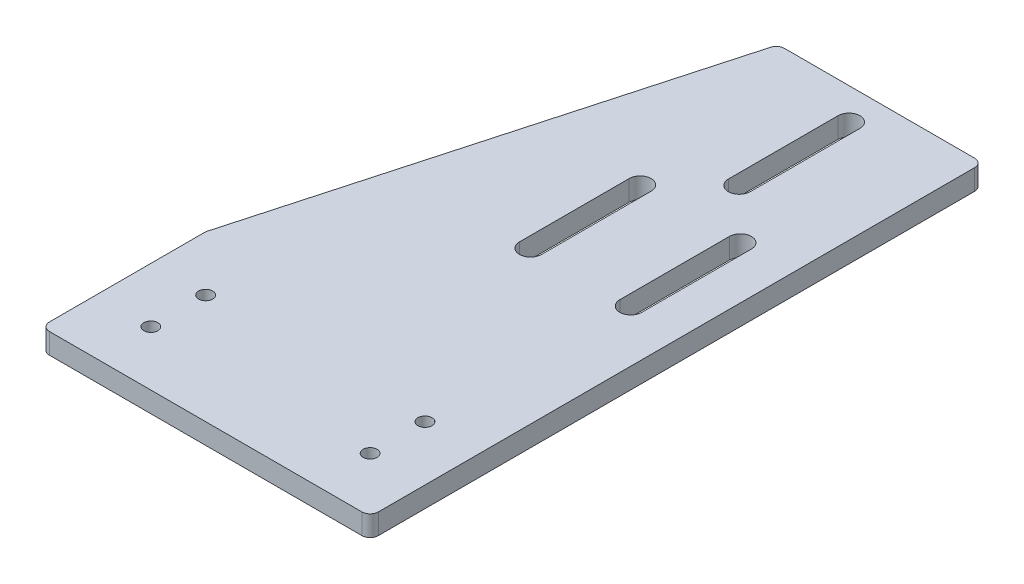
ISO-10303-21;
HEADER;
FILE_DESCRIPTION(('STEP AP214'),'2;1');
FILE_NAME('part.step','',(''),(''),'','','');
FILE_SCHEMA(('AUTOMOTIVE_DESIGN { 1 0 10303 214 1 1 1 1 }'));
ENDSEC;
DATA;
#1=APPLICATION_CONTEXT('core data for automotive mechanical design processes');
#2=APPLICATION_PROTOCOL_DEFINITION('international standard','automotive_design',2000,#1);
#3=PRODUCT_CONTEXT('',#1,'mechanical');
#4=PRODUCT('Part','Part','',(#3));
#5=PRODUCT_RELATED_PRODUCT_CATEGORY('part','',(#4));
#6=PRODUCT_DEFINITION_FORMATION('','',#4);
#7=PRODUCT_DEFINITION_CONTEXT('part definition',#1,'design');
#8=PRODUCT_DEFINITION('design','',#6,#7);
#9=PRODUCT_DEFINITION_SHAPE('','',#8);
#10=(LENGTH_UNIT() NAMED_UNIT(*) SI_UNIT(.MILLI.,.METRE.));
#11=(NAMED_UNIT(*) PLANE_ANGLE_UNIT() SI_UNIT($,.RADIAN.));
#12=(NAMED_UNIT(*) SI_UNIT($,.STERADIAN.) SOLID_ANGLE_UNIT());
#13=UNCERTAINTY_MEASURE_WITH_UNIT(LENGTH_MEASURE(1.E-05),#10,'distance_accuracy_value','');
#14=(GEOMETRIC_REPRESENTATION_CONTEXT(3) GLOBAL_UNCERTAINTY_ASSIGNED_CONTEXT((#13)) GLOBAL_UNIT_ASSIGNED_CONTEXT((#10,
#11,#12)) REPRESENTATION_CONTEXT('',''));
#15=CARTESIAN_POINT('',(0.,0.,0.));
#16=DIRECTION('',(0.,0.,1.));
#17=DIRECTION('',(1.,0.,0.));
#18=AXIS2_PLACEMENT_3D('',#15,#16,#17);
#19=CARTESIAN_POINT('',(43.583703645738,9.525,224.79));
#20=DIRECTION('',(0.,1.,0.));
#21=DIRECTION('',(0.,0.,1.));
#22=AXIS2_PLACEMENT_3D('',#19,#20,#21);
#23=PLANE('',#22);
#24=CARTESIAN_POINT('',(-79.606296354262,9.525,203.2));
#25=DIRECTION('',(0.,1.,0.));
#26=DIRECTION('',(0.,0.,1.));
#27=AXIS2_PLACEMENT_3D('',#24,#25,#26);
#28=CIRCLE('',#27,3.25119999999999);
#29=CARTESIAN_POINT('',(-79.606296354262,9.525,199.9488));
#30=VERTEX_POINT('',#29);
#31=EDGE_CURVE('E267',#30,#30,#28,.T.);
#32=ORIENTED_EDGE('',*,*,#31,.F.);
#33=EDGE_LOOP('',(#32));
#34=FACE_BOUND('',#33,.T.);
#35=CARTESIAN_POINT('',(21.993703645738,9.525,203.2));
#36=DIRECTION('',(0.,1.,0.));
#37=DIRECTION('',(0.,0.,1.));
#38=AXIS2_PLACEMENT_3D('',#35,#36,#37);
#39=CIRCLE('',#38,3.2512);
#40=CARTESIAN_POINT('',(21.993703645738,9.525,199.9488));
#41=VERTEX_POINT('',#40);
#42=EDGE_CURVE('E279',#41,#41,#39,.T.);
#43=ORIENTED_EDGE('',*,*,#42,.F.);
#44=EDGE_LOOP('',(#43));
#45=FACE_BOUND('',#44,.T.);
#46=CARTESIAN_POINT('',(43.583703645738,9.525,224.79));
#47=DIRECTION('',(0.,1.,0.));
#48=DIRECTION('',(0.,0.,1.));
#49=AXIS2_PLACEMENT_3D('',#46,#47,#48);
#50=CIRCLE('',#49,3.81);
#51=CARTESIAN_POINT('',(43.583703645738,9.525,228.6));
#52=VERTEX_POINT('',#51);
#53=CARTESIAN_POINT('',(47.393703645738,9.525,224.79));
#54=VERTEX_POINT('',#53);
#55=EDGE_CURVE('E316',#52,#54,#50,.T.);
#56=ORIENTED_EDGE('',*,*,#55,.T.);
#57=DIRECTION('',(0.,0.,-1.));
#58=VECTOR('',#57,1.);
#59=CARTESIAN_POINT('',(47.393703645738,9.525,-51.435));
#60=LINE('',#59,#58);
#61=CARTESIAN_POINT('',(47.393703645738,9.525,-51.435));
#62=VERTEX_POINT('',#61);
#63=EDGE_CURVE('E319',#54,#62,#60,.T.);
#64=ORIENTED_EDGE('',*,*,#63,.T.);
#65=CARTESIAN_POINT('',(43.583703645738,9.525,-51.435));
#66=DIRECTION('',(0.,1.,0.));
#67=DIRECTION('',(0.,0.,1.));
#68=AXIS2_PLACEMENT_3D('',#65,#66,#67);
#69=CIRCLE('',#68,3.81);
#70=CARTESIAN_POINT('',(43.583703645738,9.525,-55.245));
#71=VERTEX_POINT('',#70);
#72=EDGE_CURVE('E322',#62,#71,#69,.T.);
#73=ORIENTED_EDGE('',*,*,#72,.T.);
#74=DIRECTION('',(-1.,0.,0.));
#75=VECTOR('',#74,1.);
#76=CARTESIAN_POINT('',(-44.4968825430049,9.525,-55.245));
#77=LINE('',#76,#75);
#78=CARTESIAN_POINT('',(-44.4968825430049,9.525,-55.245));
#79=VERTEX_POINT('',#78);
#80=EDGE_CURVE('E324',#71,#79,#77,.T.);
#81=ORIENTED_EDGE('',*,*,#80,.T.);
#82=CARTESIAN_POINT('',(-44.4968825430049,9.525,-51.435));
#83=DIRECTION('',(0.,1.,0.));
#84=DIRECTION('',(0.,0.,-1.));
#85=AXIS2_PLACEMENT_3D('',#82,#83,#84);
#86=CIRCLE('',#85,3.81);
#87=CARTESIAN_POINT('',(-48.1681891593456,9.525,-52.4536303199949));
#88=VERTEX_POINT('',#87);
#89=EDGE_CURVE('E326',#79,#88,#86,.T.);
#90=ORIENTED_EDGE('',*,*,#89,.T.);
#91=DIRECTION('',(-0.267357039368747,0.,0.963597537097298));
#92=VECTOR('',#91,1.);
#93=CARTESIAN_POINT('',(-48.1681891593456,9.525,-52.4536303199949));
#94=LINE('',#93,#92);
#95=CARTESIAN_POINT('',(-104.867602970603,9.525,151.900126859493));
#96=VERTEX_POINT('',#95);
#97=EDGE_CURVE('E328',#88,#96,#94,.T.);
#98=ORIENTED_EDGE('',*,*,#97,.T.);
#99=CARTESIAN_POINT('',(-101.196296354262,9.525,152.918757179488));
#100=DIRECTION('',(0.,1.,0.));
#101=DIRECTION('',(0.,0.,1.));
#102=AXIS2_PLACEMENT_3D('',#99,#100,#101);
#103=CIRCLE('',#102,3.81);
#104=CARTESIAN_POINT('',(-105.006296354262,9.525,152.918757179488));
#105=VERTEX_POINT('',#104);
#106=EDGE_CURVE('E330',#96,#105,#103,.T.);
#107=ORIENTED_EDGE('',*,*,#106,.T.);
#108=DIRECTION('',(0.,0.,1.));
#109=VECTOR('',#108,1.);
#110=CARTESIAN_POINT('',(-105.006296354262,9.525,152.918757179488));
#111=LINE('',#110,#109);
#112=CARTESIAN_POINT('',(-105.006296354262,9.525,224.79));
#113=VERTEX_POINT('',#112);
#114=EDGE_CURVE('E332',#105,#113,#111,.T.);
#115=ORIENTED_EDGE('',*,*,#114,.T.);
#116=CARTESIAN_POINT('',(-101.196296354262,9.525,224.79));
#117=DIRECTION('',(0.,1.,0.));
#118=DIRECTION('',(0.,0.,1.));
#119=AXIS2_PLACEMENT_3D('',#116,#117,#118);
#120=CIRCLE('',#119,3.81);
#121=CARTESIAN_POINT('',(-101.196296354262,9.525,228.6));
#122=VERTEX_POINT('',#121);
#123=EDGE_CURVE('E334',#113,#122,#120,.T.);
#124=ORIENTED_EDGE('',*,*,#123,.T.);
#125=DIRECTION('',(1.,0.,0.));
#126=VECTOR('',#125,1.);
#127=CARTESIAN_POINT('',(-101.196296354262,9.525,228.6));
#128=LINE('',#127,#126);
#129=EDGE_CURVE('E336',#122,#52,#128,.T.);
#130=ORIENTED_EDGE('',*,*,#129,.T.);
#131=EDGE_LOOP('',(#56,#64,#73,#81,#90,#98,#107,#115,#124,#130));
#132=FACE_BOUND('',#131,.T.);
#133=DIRECTION('',(0.,0.,-1.));
#134=VECTOR('',#133,1.);
#135=CARTESIAN_POINT('',(28.343703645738,9.525,83.7428659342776));
#136=LINE('',#135,#134);
#137=CARTESIAN_POINT('',(28.343703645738,9.525,83.7428659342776));
#138=VERTEX_POINT('',#137);
#139=CARTESIAN_POINT('',(28.343703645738,9.525,32.9428659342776));
#140=VERTEX_POINT('',#139);
#141=EDGE_CURVE('E287',#138,#140,#136,.T.);
#142=ORIENTED_EDGE('',*,*,#141,.F.);
#143=CARTESIAN_POINT('',(23.263703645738,9.525,83.7428659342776));
#144=DIRECTION('',(0.,1.,0.));
#145=DIRECTION('',(0.,0.,1.));
#146=AXIS2_PLACEMENT_3D('',#143,#144,#145);
#147=CIRCLE('',#146,5.08);
#148=CARTESIAN_POINT('',(18.183703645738,9.525,83.7428659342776));
#149=VERTEX_POINT('',#148);
#150=EDGE_CURVE('E285',#149,#138,#147,.T.);
#151=ORIENTED_EDGE('',*,*,#150,.F.);
#152=DIRECTION('',(0.,0.,1.));
#153=VECTOR('',#152,1.);
#154=CARTESIAN_POINT('',(18.183703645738,9.525,83.7428659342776));
#155=LINE('',#154,#153);
#156=CARTESIAN_POINT('',(18.183703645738,9.525,32.9428659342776));
#157=VERTEX_POINT('',#156);
#158=EDGE_CURVE('E293',#157,#149,#155,.T.);
#159=ORIENTED_EDGE('',*,*,#158,.F.);
#160=CARTESIAN_POINT('',(23.263703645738,9.525,32.9428659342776));
#161=DIRECTION('',(0.,1.,0.));
#162=DIRECTION('',(0.,0.,1.));
#163=AXIS2_PLACEMENT_3D('',#160,#161,#162);
#164=CIRCLE('',#163,5.08);
#165=EDGE_CURVE('E290',#140,#157,#164,.T.);
#166=ORIENTED_EDGE('',*,*,#165,.F.);
#167=EDGE_LOOP('',(#142,#151,#159,#166));
#168=FACE_BOUND('',#167,.T.);
#169=CARTESIAN_POINT('',(21.993703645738,9.525,177.8));
#170=DIRECTION('',(0.,1.,0.));
#171=DIRECTION('',(0.,0.,1.));
#172=AXIS2_PLACEMENT_3D('',#169,#170,#171);
#173=CIRCLE('',#172,3.2512);
#174=CARTESIAN_POINT('',(21.993703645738,9.525,174.5488));
#175=VERTEX_POINT('',#174);
#176=EDGE_CURVE('E273',#175,#175,#173,.T.);
#177=ORIENTED_EDGE('',*,*,#176,.F.);
#178=EDGE_LOOP('',(#177));
#179=FACE_BOUND('',#178,.T.);
#180=CARTESIAN_POINT('',(-79.606296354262,9.525,177.8));
#181=DIRECTION('',(0.,1.,0.));
#182=DIRECTION('',(0.,0.,1.));
#183=AXIS2_PLACEMENT_3D('',#180,#181,#182);
#184=CIRCLE('',#183,3.25119999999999);
#185=CARTESIAN_POINT('',(-79.606296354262,9.525,174.5488));
#186=VERTEX_POINT('',#185);
#187=EDGE_CURVE('E261',#186,#186,#184,.T.);
#188=ORIENTED_EDGE('',*,*,#187,.F.);
#189=EDGE_LOOP('',(#188));
#190=FACE_BOUND('',#189,.T.);
#191=DIRECTION('',(0.,0.,-1.));
#192=VECTOR('',#191,1.);
#193=CARTESIAN_POINT('',(5.08,9.525,10.16));
#194=LINE('',#193,#192);
#195=CARTESIAN_POINT('',(5.08,9.525,10.16));
#196=VERTEX_POINT('',#195);
#197=CARTESIAN_POINT('',(5.08,9.525,-40.64));
#198=VERTEX_POINT('',#197);
#199=EDGE_CURVE('E232',#196,#198,#194,.T.);
#200=ORIENTED_EDGE('',*,*,#199,.F.);
#201=CARTESIAN_POINT('',(0.,9.525,10.16));
#202=DIRECTION('',(0.,1.,0.));
#203=DIRECTION('',(0.,0.,1.));
#204=AXIS2_PLACEMENT_3D('',#201,#202,#203);
#205=CIRCLE('',#204,5.08);
#206=CARTESIAN_POINT('',(-5.08,9.525,10.16));
#207=VERTEX_POINT('',#206);
#208=EDGE_CURVE('E230',#207,#196,#205,.T.);
#209=ORIENTED_EDGE('',*,*,#208,.F.);
#210=DIRECTION('',(0.,0.,1.));
#211=VECTOR('',#210,1.);
#212=CARTESIAN_POINT('',(-5.08,9.525,10.16));
#213=LINE('',#212,#211);
#214=CARTESIAN_POINT('',(-5.08,9.525,-40.64));
#215=VERTEX_POINT('',#214);
#216=EDGE_CURVE('E238',#215,#207,#213,.T.);
#217=ORIENTED_EDGE('',*,*,#216,.F.);
#218=CARTESIAN_POINT('',(0.,9.525,-40.64));
#219=DIRECTION('',(0.,1.,0.));
#220=DIRECTION('',(0.,0.,1.));
#221=AXIS2_PLACEMENT_3D('',#218,#219,#220);
#222=CIRCLE('',#221,5.08);
#223=EDGE_CURVE('E235',#198,#215,#222,.T.);
#224=ORIENTED_EDGE('',*,*,#223,.F.);
#225=EDGE_LOOP('',(#200,#209,#217,#224));
#226=FACE_BOUND('',#225,.T.);
#227=DIRECTION('',(0.,0.,-1.));
#228=VECTOR('',#227,1.);
#229=CARTESIAN_POINT('',(-18.0878952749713,9.525,83.7428659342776));
#230=LINE('',#229,#228);
#231=CARTESIAN_POINT('',(-18.0878952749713,9.525,83.7428659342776));
#232=VERTEX_POINT('',#231);
#233=CARTESIAN_POINT('',(-18.0878952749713,9.525,32.9428659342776));
#234=VERTEX_POINT('',#233);
#235=EDGE_CURVE('E202',#232,#234,#230,.T.);
#236=ORIENTED_EDGE('',*,*,#235,.F.);
#237=CARTESIAN_POINT('',(-23.1678952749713,9.525,83.7428659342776));
#238=DIRECTION('',(0.,1.,0.));
#239=DIRECTION('',(0.,0.,1.));
#240=AXIS2_PLACEMENT_3D('',#237,#238,#239);
#241=CIRCLE('',#240,5.08);
#242=CARTESIAN_POINT('',(-28.2478952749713,9.525,83.7428659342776));
#243=VERTEX_POINT('',#242);
#244=EDGE_CURVE('E194',#243,#232,#241,.T.);
#245=ORIENTED_EDGE('',*,*,#244,.F.);
#246=DIRECTION('',(0.,0.,1.));
#247=VECTOR('',#246,1.);
#248=CARTESIAN_POINT('',(-28.2478952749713,9.525,83.7428659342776));
#249=LINE('',#248,#247);
#250=CARTESIAN_POINT('',(-28.2478952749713,9.525,32.9428659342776));
#251=VERTEX_POINT('',#250);
#252=EDGE_CURVE('E216',#251,#243,#249,.T.);
#253=ORIENTED_EDGE('',*,*,#252,.F.);
#254=CARTESIAN_POINT('',(-23.1678952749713,9.525,32.9428659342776));
#255=DIRECTION('',(0.,1.,0.));
#256=DIRECTION('',(0.,0.,1.));
#257=AXIS2_PLACEMENT_3D('',#254,#255,#256);
#258=CIRCLE('',#257,5.08);
#259=EDGE_CURVE('E214',#234,#251,#258,.T.);
#260=ORIENTED_EDGE('',*,*,#259,.F.);
#261=EDGE_LOOP('',(#236,#245,#253,#260));
#262=FACE_BOUND('',#261,.T.);
#263=ADVANCED_FACE('F45',(#34,#45,#132,#168,#179,#190,#226,#262),#23,.T.);
#264=CARTESIAN_POINT('',(43.583703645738,0.,224.79));
#265=DIRECTION('',(0.,1.,0.));
#266=DIRECTION('',(0.,0.,1.));
#267=AXIS2_PLACEMENT_3D('',#264,#265,#266);
#268=PLANE('',#267);
#269=CARTESIAN_POINT('',(0.,0.,10.16));
#270=DIRECTION('',(0.,1.,0.));
#271=DIRECTION('',(0.,0.,1.));
#272=AXIS2_PLACEMENT_3D('',#269,#270,#271);
#273=CIRCLE('',#272,5.08);
#274=CARTESIAN_POINT('',(-5.08,0.,10.16));
#275=VERTEX_POINT('',#274);
#276=CARTESIAN_POINT('',(5.08,0.,10.16));
#277=VERTEX_POINT('',#276);
#278=EDGE_CURVE('E210',#275,#277,#273,.T.);
#279=ORIENTED_EDGE('',*,*,#278,.T.);
#280=DIRECTION('',(0.,0.,-1.));
#281=VECTOR('',#280,1.);
#282=CARTESIAN_POINT('',(5.08,0.,10.16));
#283=LINE('',#282,#281);
#284=CARTESIAN_POINT('',(5.08,0.,-40.64));
#285=VERTEX_POINT('',#284);
#286=EDGE_CURVE('E243',#277,#285,#283,.T.);
#287=ORIENTED_EDGE('',*,*,#286,.T.);
#288=CARTESIAN_POINT('',(0.,0.,-40.64));
#289=DIRECTION('',(0.,1.,0.));
#290=DIRECTION('',(0.,0.,1.));
#291=AXIS2_PLACEMENT_3D('',#288,#289,#290);
#292=CIRCLE('',#291,5.08);
#293=CARTESIAN_POINT('',(-5.08,0.,-40.64));
#294=VERTEX_POINT('',#293);
#295=EDGE_CURVE('E246',#285,#294,#292,.T.);
#296=ORIENTED_EDGE('',*,*,#295,.T.);
#297=DIRECTION('',(0.,0.,1.));
#298=VECTOR('',#297,1.);
#299=CARTESIAN_POINT('',(-5.08,0.,10.16));
#300=LINE('',#299,#298);
#301=EDGE_CURVE('E233',#294,#275,#300,.T.);
#302=ORIENTED_EDGE('',*,*,#301,.T.);
#303=EDGE_LOOP('',(#279,#287,#296,#302));
#304=FACE_BOUND('',#303,.T.);
#305=CARTESIAN_POINT('',(43.583703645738,0.,224.79));
#306=DIRECTION('',(0.,1.,0.));
#307=DIRECTION('',(0.,0.,1.));
#308=AXIS2_PLACEMENT_3D('',#305,#306,#307);
#309=CIRCLE('',#308,3.81);
#310=CARTESIAN_POINT('',(43.583703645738,0.,228.6));
#311=VERTEX_POINT('',#310);
#312=CARTESIAN_POINT('',(47.393703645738,0.,224.79));
#313=VERTEX_POINT('',#312);
#314=EDGE_CURVE('E315',#311,#313,#309,.T.);
#315=ORIENTED_EDGE('',*,*,#314,.F.);
#316=DIRECTION('',(1.,0.,0.));
#317=VECTOR('',#316,1.);
#318=CARTESIAN_POINT('',(-101.196296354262,0.,228.6));
#319=LINE('',#318,#317);
#320=CARTESIAN_POINT('',(-101.196296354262,0.,228.6));
#321=VERTEX_POINT('',#320);
#322=EDGE_CURVE('E320',#321,#311,#319,.T.);
#323=ORIENTED_EDGE('',*,*,#322,.F.);
#324=CARTESIAN_POINT('',(-101.196296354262,0.,224.79));
#325=DIRECTION('',(0.,1.,0.));
#326=DIRECTION('',(0.,0.,1.));
#327=AXIS2_PLACEMENT_3D('',#324,#325,#326);
#328=CIRCLE('',#327,3.81);
#329=CARTESIAN_POINT('',(-105.006296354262,0.,224.79));
#330=VERTEX_POINT('',#329);
#331=EDGE_CURVE('E355',#330,#321,#328,.T.);
#332=ORIENTED_EDGE('',*,*,#331,.F.);
#333=DIRECTION('',(0.,0.,1.));
#334=VECTOR('',#333,1.);
#335=CARTESIAN_POINT('',(-105.006296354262,0.,152.918757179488));
#336=LINE('',#335,#334);
#337=CARTESIAN_POINT('',(-105.006296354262,0.,152.918757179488));
#338=VERTEX_POINT('',#337);
#339=EDGE_CURVE('E353',#338,#330,#336,.T.);
#340=ORIENTED_EDGE('',*,*,#339,.F.);
#341=CARTESIAN_POINT('',(-101.196296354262,0.,152.918757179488));
#342=DIRECTION('',(0.,1.,0.));
#343=DIRECTION('',(0.,0.,1.));
#344=AXIS2_PLACEMENT_3D('',#341,#342,#343);
#345=CIRCLE('',#344,3.81);
#346=CARTESIAN_POINT('',(-104.867602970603,0.,151.900126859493));
#347=VERTEX_POINT('',#346);
#348=EDGE_CURVE('E351',#347,#338,#345,.T.);
#349=ORIENTED_EDGE('',*,*,#348,.F.);
#350=DIRECTION('',(-0.267357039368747,0.,0.963597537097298));
#351=VECTOR('',#350,1.);
#352=CARTESIAN_POINT('',(-48.1681891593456,0.,-52.4536303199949));
#353=LINE('',#352,#351);
#354=CARTESIAN_POINT('',(-48.1681891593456,0.,-52.4536303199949));
#355=VERTEX_POINT('',#354);
#356=EDGE_CURVE('E349',#355,#347,#353,.T.);
#357=ORIENTED_EDGE('',*,*,#356,.F.);
#358=CARTESIAN_POINT('',(-44.4968825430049,0.,-51.435));
#359=DIRECTION('',(0.,1.,0.));
#360=DIRECTION('',(0.,0.,-1.));
#361=AXIS2_PLACEMENT_3D('',#358,#359,#360);
#362=CIRCLE('',#361,3.81);
#363=CARTESIAN_POINT('',(-44.4968825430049,0.,-55.245));
#364=VERTEX_POINT('',#363);
#365=EDGE_CURVE('E347',#364,#355,#362,.T.);
#366=ORIENTED_EDGE('',*,*,#365,.F.);
#367=DIRECTION('',(-1.,0.,0.));
#368=VECTOR('',#367,1.);
#369=CARTESIAN_POINT('',(-44.4968825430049,0.,-55.245));
#370=LINE('',#369,#368);
#371=CARTESIAN_POINT('',(43.583703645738,0.,-55.245));
#372=VERTEX_POINT('',#371);
#373=EDGE_CURVE('E345',#372,#364,#370,.T.);
#374=ORIENTED_EDGE('',*,*,#373,.F.);
#375=CARTESIAN_POINT('',(43.583703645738,0.,-51.435));
#376=DIRECTION('',(0.,1.,0.));
#377=DIRECTION('',(0.,0.,1.));
#378=AXIS2_PLACEMENT_3D('',#375,#376,#377);
#379=CIRCLE('',#378,3.81);
#380=CARTESIAN_POINT('',(47.393703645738,0.,-51.435));
#381=VERTEX_POINT('',#380);
#382=EDGE_CURVE('E343',#381,#372,#379,.T.);
#383=ORIENTED_EDGE('',*,*,#382,.F.);
#384=DIRECTION('',(0.,0.,-1.));
#385=VECTOR('',#384,1.);
#386=CARTESIAN_POINT('',(47.393703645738,0.,-51.435));
#387=LINE('',#386,#385);
#388=EDGE_CURVE('E341',#313,#381,#387,.T.);
#389=ORIENTED_EDGE('',*,*,#388,.F.);
#390=EDGE_LOOP('',(#315,#323,#332,#340,#349,#357,#366,#374,#383,#389));
#391=FACE_BOUND('',#390,.T.);
#392=CARTESIAN_POINT('',(23.263703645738,0.,83.7428659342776));
#393=DIRECTION('',(0.,1.,0.));
#394=DIRECTION('',(0.,0.,1.));
#395=AXIS2_PLACEMENT_3D('',#392,#393,#394);
#396=CIRCLE('',#395,5.08);
#397=CARTESIAN_POINT('',(18.183703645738,0.,83.7428659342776));
#398=VERTEX_POINT('',#397);
#399=CARTESIAN_POINT('',(28.343703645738,0.,83.7428659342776));
#400=VERTEX_POINT('',#399);
#401=EDGE_CURVE('E282',#398,#400,#396,.T.);
#402=ORIENTED_EDGE('',*,*,#401,.T.);
#403=DIRECTION('',(0.,0.,-1.));
#404=VECTOR('',#403,1.);
#405=CARTESIAN_POINT('',(28.343703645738,0.,83.7428659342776));
#406=LINE('',#405,#404);
#407=CARTESIAN_POINT('',(28.343703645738,0.,32.9428659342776));
#408=VERTEX_POINT('',#407);
#409=EDGE_CURVE('E298',#400,#408,#406,.T.);
#410=ORIENTED_EDGE('',*,*,#409,.T.);
#411=CARTESIAN_POINT('',(23.263703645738,0.,32.9428659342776));
#412=DIRECTION('',(0.,1.,0.));
#413=DIRECTION('',(0.,0.,1.));
#414=AXIS2_PLACEMENT_3D('',#411,#412,#413);
#415=CIRCLE('',#414,5.08);
#416=CARTESIAN_POINT('',(18.183703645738,0.,32.9428659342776));
#417=VERTEX_POINT('',#416);
#418=EDGE_CURVE('E301',#408,#417,#415,.T.);
#419=ORIENTED_EDGE('',*,*,#418,.T.);
#420=DIRECTION('',(0.,0.,1.));
#421=VECTOR('',#420,1.);
#422=CARTESIAN_POINT('',(18.183703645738,0.,83.7428659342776));
#423=LINE('',#422,#421);
#424=EDGE_CURVE('E288',#417,#398,#423,.T.);
#425=ORIENTED_EDGE('',*,*,#424,.T.);
#426=EDGE_LOOP('',(#402,#410,#419,#425));
#427=FACE_BOUND('',#426,.T.);
#428=CARTESIAN_POINT('',(21.993703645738,0.,203.2));
#429=DIRECTION('',(0.,1.,0.));
#430=DIRECTION('',(0.,0.,1.));
#431=AXIS2_PLACEMENT_3D('',#428,#429,#430);
#432=CIRCLE('',#431,3.2512);
#433=CARTESIAN_POINT('',(21.993703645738,0.,199.9488));
#434=VERTEX_POINT('',#433);
#435=EDGE_CURVE('E276',#434,#434,#432,.T.);
#436=ORIENTED_EDGE('',*,*,#435,.T.);
#437=EDGE_LOOP('',(#436));
#438=FACE_BOUND('',#437,.T.);
#439=CARTESIAN_POINT('',(21.993703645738,0.,177.8));
#440=DIRECTION('',(0.,1.,0.));
#441=DIRECTION('',(0.,0.,1.));
#442=AXIS2_PLACEMENT_3D('',#439,#440,#441);
#443=CIRCLE('',#442,3.2512);
#444=CARTESIAN_POINT('',(21.993703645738,0.,174.5488));
#445=VERTEX_POINT('',#444);
#446=EDGE_CURVE('E270',#445,#445,#443,.T.);
#447=ORIENTED_EDGE('',*,*,#446,.T.);
#448=EDGE_LOOP('',(#447));
#449=FACE_BOUND('',#448,.T.);
#450=CARTESIAN_POINT('',(-79.606296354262,0.,203.2));
#451=DIRECTION('',(0.,1.,0.));
#452=DIRECTION('',(0.,0.,1.));
#453=AXIS2_PLACEMENT_3D('',#450,#451,#452);
#454=CIRCLE('',#453,3.25119999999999);
#455=CARTESIAN_POINT('',(-79.606296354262,0.,199.9488));
#456=VERTEX_POINT('',#455);
#457=EDGE_CURVE('E264',#456,#456,#454,.T.);
#458=ORIENTED_EDGE('',*,*,#457,.T.);
#459=EDGE_LOOP('',(#458));
#460=FACE_BOUND('',#459,.T.);
#461=CARTESIAN_POINT('',(-79.606296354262,0.,177.8));
#462=DIRECTION('',(0.,1.,0.));
#463=DIRECTION('',(0.,0.,1.));
#464=AXIS2_PLACEMENT_3D('',#461,#462,#463);
#465=CIRCLE('',#464,3.25119999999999);
#466=CARTESIAN_POINT('',(-79.606296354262,0.,174.5488));
#467=VERTEX_POINT('',#466);
#468=EDGE_CURVE('E260',#467,#467,#465,.T.);
#469=ORIENTED_EDGE('',*,*,#468,.T.);
#470=EDGE_LOOP('',(#469));
#471=FACE_BOUND('',#470,.T.);
#472=CARTESIAN_POINT('',(-23.1678952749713,0.,83.7428659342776));
#473=DIRECTION('',(0.,1.,0.));
#474=DIRECTION('',(0.,0.,1.));
#475=AXIS2_PLACEMENT_3D('',#472,#473,#474);
#476=CIRCLE('',#475,5.08);
#477=CARTESIAN_POINT('',(-28.2478952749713,0.,83.7428659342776));
#478=VERTEX_POINT('',#477);
#479=CARTESIAN_POINT('',(-18.0878952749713,0.,83.7428659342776));
#480=VERTEX_POINT('',#479);
#481=EDGE_CURVE('E68',#478,#480,#476,.T.);
#482=ORIENTED_EDGE('',*,*,#481,.T.);
#483=DIRECTION('',(0.,0.,-1.));
#484=VECTOR('',#483,1.);
#485=CARTESIAN_POINT('',(-18.0878952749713,0.,83.7428659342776));
#486=LINE('',#485,#484);
#487=CARTESIAN_POINT('',(-18.0878952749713,0.,32.9428659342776));
#488=VERTEX_POINT('',#487);
#489=EDGE_CURVE('E209',#480,#488,#486,.T.);
#490=ORIENTED_EDGE('',*,*,#489,.T.);
#491=CARTESIAN_POINT('',(-23.1678952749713,0.,32.9428659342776));
#492=DIRECTION('',(0.,1.,0.));
#493=DIRECTION('',(0.,0.,1.));
#494=AXIS2_PLACEMENT_3D('',#491,#492,#493);
#495=CIRCLE('',#494,5.08);
#496=CARTESIAN_POINT('',(-28.2478952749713,0.,32.9428659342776));
#497=VERTEX_POINT('',#496);
#498=EDGE_CURVE('E222',#488,#497,#495,.T.);
#499=ORIENTED_EDGE('',*,*,#498,.T.);
#500=DIRECTION('',(0.,0.,1.));
#501=VECTOR('',#500,1.);
#502=CARTESIAN_POINT('',(-28.2478952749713,0.,83.7428659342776));
#503=LINE('',#502,#501);
#504=EDGE_CURVE('E203',#497,#478,#503,.T.);
#505=ORIENTED_EDGE('',*,*,#504,.T.);
#506=EDGE_LOOP('',(#482,#490,#499,#505));
#507=FACE_BOUND('',#506,.T.);
#508=ADVANCED_FACE('F391',(#304,#391,#427,#438,#449,#460,#471,#507),#268,.F.);
#509=CARTESIAN_POINT('',(43.583703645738,9.525,224.79));
#510=DIRECTION('',(0.,-1.,0.));
#511=DIRECTION('',(0.,0.,-1.));
#512=AXIS2_PLACEMENT_3D('',#509,#510,#511);
#513=CYLINDRICAL_SURFACE('',#512,3.81);
#514=ORIENTED_EDGE('',*,*,#314,.T.);
#515=DIRECTION('',(0.,-1.,0.));
#516=VECTOR('',#515,1.);
#517=CARTESIAN_POINT('',(47.393703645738,9.525,224.79));
#518=LINE('',#517,#516);
#519=EDGE_CURVE('E11',#54,#313,#518,.T.);
#520=ORIENTED_EDGE('',*,*,#519,.F.);
#521=ORIENTED_EDGE('',*,*,#55,.F.);
#522=DIRECTION('',(0.,-1.,0.));
#523=VECTOR('',#522,1.);
#524=CARTESIAN_POINT('',(43.583703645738,9.525,228.6));
#525=LINE('',#524,#523);
#526=EDGE_CURVE('E338',#52,#311,#525,.T.);
#527=ORIENTED_EDGE('',*,*,#526,.T.);
#528=EDGE_LOOP('',(#514,#520,#521,#527));
#529=FACE_BOUND('',#528,.T.);
#530=ADVANCED_FACE('F47',(#529),#513,.T.);
#531=CARTESIAN_POINT('',(47.393703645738,9.525,-51.435));
#532=DIRECTION('',(-1.,0.,0.));
#533=DIRECTION('',(0.,0.,1.));
#534=AXIS2_PLACEMENT_3D('',#531,#532,#533);
#535=PLANE('',#534);
#536=ORIENTED_EDGE('',*,*,#388,.T.);
#537=DIRECTION('',(0.,-1.,0.));
#538=VECTOR('',#537,1.);
#539=CARTESIAN_POINT('',(47.393703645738,9.525,-51.435));
#540=LINE('',#539,#538);
#541=EDGE_CURVE('E53',#62,#381,#540,.T.);
#542=ORIENTED_EDGE('',*,*,#541,.F.);
#543=ORIENTED_EDGE('',*,*,#63,.F.);
#544=ORIENTED_EDGE('',*,*,#519,.T.);
#545=EDGE_LOOP('',(#536,#542,#543,#544));
#546=FACE_BOUND('',#545,.T.);
#547=ADVANCED_FACE('F409',(#546),#535,.F.);
#548=CARTESIAN_POINT('',(43.583703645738,9.525,-51.435));
#549=DIRECTION('',(0.,-1.,0.));
#550=DIRECTION('',(0.,0.,-1.));
#551=AXIS2_PLACEMENT_3D('',#548,#549,#550);
#552=CYLINDRICAL_SURFACE('',#551,3.81);
#553=ORIENTED_EDGE('',*,*,#382,.T.);
#554=DIRECTION('',(0.,-1.,0.));
#555=VECTOR('',#554,1.);
#556=CARTESIAN_POINT('',(43.583703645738,9.525,-55.245));
#557=LINE('',#556,#555);
#558=EDGE_CURVE('E378',#71,#372,#557,.T.);
#559=ORIENTED_EDGE('',*,*,#558,.F.);
#560=ORIENTED_EDGE('',*,*,#72,.F.);
#561=ORIENTED_EDGE('',*,*,#541,.T.);
#562=EDGE_LOOP('',(#553,#559,#560,#561));
#563=FACE_BOUND('',#562,.T.);
#564=ADVANCED_FACE('F385',(#563),#552,.T.);
#565=CARTESIAN_POINT('',(-44.4968825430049,9.525,-55.245));
#566=DIRECTION('',(0.,0.,1.));
#567=DIRECTION('',(1.,0.,0.));
#568=AXIS2_PLACEMENT_3D('',#565,#566,#567);
#569=PLANE('',#568);
#570=ORIENTED_EDGE('',*,*,#373,.T.);
#571=DIRECTION('',(0.,-1.,0.));
#572=VECTOR('',#571,1.);
#573=CARTESIAN_POINT('',(-44.4968825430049,9.525,-55.245));
#574=LINE('',#573,#572);
#575=EDGE_CURVE('E375',#79,#364,#574,.T.);
#576=ORIENTED_EDGE('',*,*,#575,.F.);
#577=ORIENTED_EDGE('',*,*,#80,.F.);
#578=ORIENTED_EDGE('',*,*,#558,.T.);
#579=EDGE_LOOP('',(#570,#576,#577,#578));
#580=FACE_BOUND('',#579,.T.);
#581=ADVANCED_FACE('F397',(#580),#569,.F.);
#582=CARTESIAN_POINT('',(-44.4968825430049,9.525,-51.435));
#583=DIRECTION('',(0.,-1.,0.));
#584=DIRECTION('',(0.,0.,-1.));
#585=AXIS2_PLACEMENT_3D('',#582,#583,#584);
#586=CYLINDRICAL_SURFACE('',#585,3.81);
#587=ORIENTED_EDGE('',*,*,#365,.T.);
#588=DIRECTION('',(0.,-1.,0.));
#589=VECTOR('',#588,1.);
#590=CARTESIAN_POINT('',(-48.1681891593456,9.525,-52.4536303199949));
#591=LINE('',#590,#589);
#592=EDGE_CURVE('E372',#88,#355,#591,.T.);
#593=ORIENTED_EDGE('',*,*,#592,.F.);
#594=ORIENTED_EDGE('',*,*,#89,.F.);
#595=ORIENTED_EDGE('',*,*,#575,.T.);
#596=EDGE_LOOP('',(#587,#593,#594,#595));
#597=FACE_BOUND('',#596,.T.);
#598=ADVANCED_FACE('F401',(#597),#586,.T.);
#599=CARTESIAN_POINT('',(-48.1681891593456,9.525,-52.4536303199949));
#600=DIRECTION('',(0.963597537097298,0.,0.267357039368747));
#601=DIRECTION('',(0.267357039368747,0.,-0.963597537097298));
#602=AXIS2_PLACEMENT_3D('',#599,#600,#601);
#603=PLANE('',#602);
#604=ORIENTED_EDGE('',*,*,#356,.T.);
#605=DIRECTION('',(0.,-1.,0.));
#606=VECTOR('',#605,1.);
#607=CARTESIAN_POINT('',(-104.867602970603,9.525,151.900126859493));
#608=LINE('',#607,#606);
#609=EDGE_CURVE('E369',#96,#347,#608,.T.);
#610=ORIENTED_EDGE('',*,*,#609,.F.);
#611=ORIENTED_EDGE('',*,*,#97,.F.);
#612=ORIENTED_EDGE('',*,*,#592,.T.);
#613=EDGE_LOOP('',(#604,#610,#611,#612));
#614=FACE_BOUND('',#613,.T.);
#615=ADVANCED_FACE('F432',(#614),#603,.F.);
#616=CARTESIAN_POINT('',(-101.196296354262,9.525,152.918757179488));
#617=DIRECTION('',(0.,-1.,0.));
#618=DIRECTION('',(0.,0.,-1.));
#619=AXIS2_PLACEMENT_3D('',#616,#617,#618);
#620=CYLINDRICAL_SURFACE('',#619,3.81);
#621=ORIENTED_EDGE('',*,*,#348,.T.);
#622=DIRECTION('',(0.,-1.,0.));
#623=VECTOR('',#622,1.);
#624=CARTESIAN_POINT('',(-105.006296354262,9.525,152.918757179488));
#625=LINE('',#624,#623);
#626=EDGE_CURVE('E366',#105,#338,#625,.T.);
#627=ORIENTED_EDGE('',*,*,#626,.F.);
#628=ORIENTED_EDGE('',*,*,#106,.F.);
#629=ORIENTED_EDGE('',*,*,#609,.T.);
#630=EDGE_LOOP('',(#621,#627,#628,#629));
#631=FACE_BOUND('',#630,.T.);
#632=ADVANCED_FACE('F429',(#631),#620,.T.);
#633=CARTESIAN_POINT('',(-105.006296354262,9.525,152.918757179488));
#634=DIRECTION('',(1.,0.,0.));
#635=DIRECTION('',(0.,0.,-1.));
#636=AXIS2_PLACEMENT_3D('',#633,#634,#635);
#637=PLANE('',#636);
#638=ORIENTED_EDGE('',*,*,#339,.T.);
#639=DIRECTION('',(0.,-1.,0.));
#640=VECTOR('',#639,1.);
#641=CARTESIAN_POINT('',(-105.006296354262,9.525,224.79));
#642=LINE('',#641,#640);
#643=EDGE_CURVE('E363',#113,#330,#642,.T.);
#644=ORIENTED_EDGE('',*,*,#643,.F.);
#645=ORIENTED_EDGE('',*,*,#114,.F.);
#646=ORIENTED_EDGE('',*,*,#626,.T.);
#647=EDGE_LOOP('',(#638,#644,#645,#646));
#648=FACE_BOUND('',#647,.T.);
#649=ADVANCED_FACE('F425',(#648),#637,.F.);
#650=CARTESIAN_POINT('',(-101.196296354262,9.525,224.79));
#651=DIRECTION('',(0.,-1.,0.));
#652=DIRECTION('',(0.,0.,-1.));
#653=AXIS2_PLACEMENT_3D('',#650,#651,#652);
#654=CYLINDRICAL_SURFACE('',#653,3.81);
#655=ORIENTED_EDGE('',*,*,#331,.T.);
#656=DIRECTION('',(0.,-1.,0.));
#657=VECTOR('',#656,1.);
#658=CARTESIAN_POINT('',(-101.196296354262,9.525,228.6));
#659=LINE('',#658,#657);
#660=EDGE_CURVE('E360',#122,#321,#659,.T.);
#661=ORIENTED_EDGE('',*,*,#660,.F.);
#662=ORIENTED_EDGE('',*,*,#123,.F.);
#663=ORIENTED_EDGE('',*,*,#643,.T.);
#664=EDGE_LOOP('',(#655,#661,#662,#663));
#665=FACE_BOUND('',#664,.T.);
#666=ADVANCED_FACE('F421',(#665),#654,.T.);
#667=CARTESIAN_POINT('',(-101.196296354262,9.525,228.6));
#668=DIRECTION('',(0.,0.,-1.));
#669=DIRECTION('',(-1.,0.,0.));
#670=AXIS2_PLACEMENT_3D('',#667,#668,#669);
#671=PLANE('',#670);
#672=ORIENTED_EDGE('',*,*,#322,.T.);
#673=ORIENTED_EDGE('',*,*,#526,.F.);
#674=ORIENTED_EDGE('',*,*,#129,.F.);
#675=ORIENTED_EDGE('',*,*,#660,.T.);
#676=EDGE_LOOP('',(#672,#673,#674,#675));
#677=FACE_BOUND('',#676,.T.);
#678=ADVANCED_FACE('F416',(#677),#671,.F.);
#679=CARTESIAN_POINT('',(23.263703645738,9.525,83.7428659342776));
#680=DIRECTION('',(0.,-1.,0.));
#681=DIRECTION('',(0.,0.,-1.));
#682=AXIS2_PLACEMENT_3D('',#679,#680,#681);
#683=CYLINDRICAL_SURFACE('',#682,5.08);
#684=ORIENTED_EDGE('',*,*,#401,.F.);
#685=DIRECTION('',(0.,-1.,0.));
#686=VECTOR('',#685,1.);
#687=CARTESIAN_POINT('',(18.183703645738,9.525,83.7428659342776));
#688=LINE('',#687,#686);
#689=EDGE_CURVE('E295',#149,#398,#688,.T.);
#690=ORIENTED_EDGE('',*,*,#689,.F.);
#691=ORIENTED_EDGE('',*,*,#150,.T.);
#692=DIRECTION('',(0.,-1.,0.));
#693=VECTOR('',#692,1.);
#694=CARTESIAN_POINT('',(28.343703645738,9.525,83.7428659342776));
#695=LINE('',#694,#693);
#696=EDGE_CURVE('E312',#138,#400,#695,.T.);
#697=ORIENTED_EDGE('',*,*,#696,.T.);
#698=EDGE_LOOP('',(#684,#690,#691,#697));
#699=FACE_BOUND('',#698,.T.);
#700=ADVANCED_FACE('F452',(#699),#683,.F.);
#701=CARTESIAN_POINT('',(28.343703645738,9.525,83.7428659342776));
#702=DIRECTION('',(-1.,0.,0.));
#703=DIRECTION('',(0.,0.,1.));
#704=AXIS2_PLACEMENT_3D('',#701,#702,#703);
#705=PLANE('',#704);
#706=ORIENTED_EDGE('',*,*,#409,.F.);
#707=ORIENTED_EDGE('',*,*,#696,.F.);
#708=ORIENTED_EDGE('',*,*,#141,.T.);
#709=DIRECTION('',(0.,-1.,0.));
#710=VECTOR('',#709,1.);
#711=CARTESIAN_POINT('',(28.343703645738,9.525,32.9428659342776));
#712=LINE('',#711,#710);
#713=EDGE_CURVE('E310',#140,#408,#712,.T.);
#714=ORIENTED_EDGE('',*,*,#713,.T.);
#715=EDGE_LOOP('',(#706,#707,#708,#714));
#716=FACE_BOUND('',#715,.T.);
#717=ADVANCED_FACE('F478',(#716),#705,.T.);
#718=CARTESIAN_POINT('',(23.263703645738,9.525,32.9428659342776));
#719=DIRECTION('',(0.,-1.,0.));
#720=DIRECTION('',(0.,0.,-1.));
#721=AXIS2_PLACEMENT_3D('',#718,#719,#720);
#722=CYLINDRICAL_SURFACE('',#721,5.08);
#723=ORIENTED_EDGE('',*,*,#418,.F.);
#724=ORIENTED_EDGE('',*,*,#713,.F.);
#725=ORIENTED_EDGE('',*,*,#165,.T.);
#726=DIRECTION('',(0.,-1.,0.));
#727=VECTOR('',#726,1.);
#728=CARTESIAN_POINT('',(18.183703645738,9.525,32.9428659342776));
#729=LINE('',#728,#727);
#730=EDGE_CURVE('E308',#157,#417,#729,.T.);
#731=ORIENTED_EDGE('',*,*,#730,.T.);
#732=EDGE_LOOP('',(#723,#724,#725,#731));
#733=FACE_BOUND('',#732,.T.);
#734=ADVANCED_FACE('F485',(#733),#722,.F.);
#735=CARTESIAN_POINT('',(18.183703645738,9.525,83.7428659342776));
#736=DIRECTION('',(1.,0.,0.));
#737=DIRECTION('',(0.,0.,-1.));
#738=AXIS2_PLACEMENT_3D('',#735,#736,#737);
#739=PLANE('',#738);
#740=ORIENTED_EDGE('',*,*,#424,.F.);
#741=ORIENTED_EDGE('',*,*,#730,.F.);
#742=ORIENTED_EDGE('',*,*,#158,.T.);
#743=ORIENTED_EDGE('',*,*,#689,.T.);
#744=EDGE_LOOP('',(#740,#741,#742,#743));
#745=FACE_BOUND('',#744,.T.);
#746=ADVANCED_FACE('F492',(#745),#739,.T.);
#747=CARTESIAN_POINT('',(21.993703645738,9.525,203.2));
#748=DIRECTION('',(0.,-1.,0.));
#749=DIRECTION('',(0.,0.,-1.));
#750=AXIS2_PLACEMENT_3D('',#747,#748,#749);
#751=CYLINDRICAL_SURFACE('',#750,3.2512);
#752=CARTESIAN_POINT('',(21.993703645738,9.525,199.9488));
#753=CARTESIAN_POINT('',(21.993703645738,9.42578125,199.9488));
#754=CARTESIAN_POINT('',(21.993703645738,9.3265625,199.9488));
#755=CARTESIAN_POINT('',(21.993703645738,9.128125,199.9488));
#756=CARTESIAN_POINT('',(21.993703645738,9.02890625,199.9488));
#757=CARTESIAN_POINT('',(21.993703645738,8.83046875,199.9488));
#758=CARTESIAN_POINT('',(21.993703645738,8.73125,199.9488));
#759=CARTESIAN_POINT('',(21.993703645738,8.5328125,199.9488));
#760=CARTESIAN_POINT('',(21.993703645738,8.43359375,199.9488));
#761=CARTESIAN_POINT('',(21.993703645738,8.23515625,199.9488));
#762=CARTESIAN_POINT('',(21.993703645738,8.1359375,199.9488));
#763=CARTESIAN_POINT('',(21.993703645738,7.9375,199.9488));
#764=CARTESIAN_POINT('',(21.993703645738,7.83828125,199.9488));
#765=CARTESIAN_POINT('',(21.993703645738,7.63984375,199.9488));
#766=CARTESIAN_POINT('',(21.993703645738,7.540625,199.9488));
#767=CARTESIAN_POINT('',(21.993703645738,7.3421875,199.9488));
#768=CARTESIAN_POINT('',(21.993703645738,7.24296875,199.9488));
#769=CARTESIAN_POINT('',(21.993703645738,7.04453125,199.9488));
#770=CARTESIAN_POINT('',(21.993703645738,6.9453125,199.9488));
#771=CARTESIAN_POINT('',(21.993703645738,6.746875,199.9488));
#772=CARTESIAN_POINT('',(21.993703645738,6.64765625,199.9488));
#773=CARTESIAN_POINT('',(21.993703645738,6.44921875,199.9488));
#774=CARTESIAN_POINT('',(21.993703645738,6.35,199.9488));
#775=CARTESIAN_POINT('',(21.993703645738,6.1515625,199.9488));
#776=CARTESIAN_POINT('',(21.993703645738,6.05234375,199.9488));
#777=CARTESIAN_POINT('',(21.993703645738,5.85390625,199.9488));
#778=CARTESIAN_POINT('',(21.993703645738,5.7546875,199.9488));
#779=CARTESIAN_POINT('',(21.993703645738,5.55625,199.9488));
#780=CARTESIAN_POINT('',(21.993703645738,5.45703125,199.9488));
#781=CARTESIAN_POINT('',(21.993703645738,5.25859375,199.9488));
#782=CARTESIAN_POINT('',(21.993703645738,5.159375,199.9488));
#783=CARTESIAN_POINT('',(21.993703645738,4.9609375,199.9488));
#784=CARTESIAN_POINT('',(21.993703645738,4.86171875,199.9488));
#785=CARTESIAN_POINT('',(21.993703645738,4.66328125,199.9488));
#786=CARTESIAN_POINT('',(21.993703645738,4.5640625,199.9488));
#787=CARTESIAN_POINT('',(21.993703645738,4.365625,199.9488));
#788=CARTESIAN_POINT('',(21.993703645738,4.26640625,199.9488));
#789=CARTESIAN_POINT('',(21.993703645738,4.06796875,199.9488));
#790=CARTESIAN_POINT('',(21.993703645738,3.96875,199.9488));
#791=CARTESIAN_POINT('',(21.993703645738,3.7703125,199.9488));
#792=CARTESIAN_POINT('',(21.993703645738,3.67109375,199.9488));
#793=CARTESIAN_POINT('',(21.993703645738,3.47265625,199.9488));
#794=CARTESIAN_POINT('',(21.993703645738,3.3734375,199.9488));
#795=CARTESIAN_POINT('',(21.993703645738,3.175,199.9488));
#796=CARTESIAN_POINT('',(21.993703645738,3.07578125,199.9488));
#797=CARTESIAN_POINT('',(21.993703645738,2.87734375,199.9488));
#798=CARTESIAN_POINT('',(21.993703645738,2.778125,199.9488));
#799=CARTESIAN_POINT('',(21.993703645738,2.5796875,199.9488));
#800=CARTESIAN_POINT('',(21.993703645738,2.48046875,199.9488));
#801=CARTESIAN_POINT('',(21.993703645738,2.28203125,199.9488));
#802=CARTESIAN_POINT('',(21.993703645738,2.1828125,199.9488));
#803=CARTESIAN_POINT('',(21.993703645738,1.984375,199.9488));
#804=CARTESIAN_POINT('',(21.993703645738,1.88515625,199.9488));
#805=CARTESIAN_POINT('',(21.993703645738,1.68671875,199.9488));
#806=CARTESIAN_POINT('',(21.993703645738,1.5875,199.9488));
#807=CARTESIAN_POINT('',(21.993703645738,1.3890625,199.9488));
#808=CARTESIAN_POINT('',(21.993703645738,1.28984375,199.9488));
#809=CARTESIAN_POINT('',(21.993703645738,1.09140625,199.9488));
#810=CARTESIAN_POINT('',(21.993703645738,0.992187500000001,199.9488));
#811=CARTESIAN_POINT('',(21.993703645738,0.793750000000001,199.9488));
#812=CARTESIAN_POINT('',(21.993703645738,0.69453125,199.9488));
#813=CARTESIAN_POINT('',(21.993703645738,0.49609375,199.9488));
#814=CARTESIAN_POINT('',(21.993703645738,0.396875,199.9488));
#815=CARTESIAN_POINT('',(21.993703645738,0.1984375,199.9488));
#816=CARTESIAN_POINT('',(21.993703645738,0.0992187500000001,199.9488));
#817=CARTESIAN_POINT('',(21.993703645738,0.,199.9488));
#818=B_SPLINE_CURVE_WITH_KNOTS('',3,(#752,#753,#754,#755,#756,#757,#758,#759,#760,#761,#762,
#763,#764,#765,#766,#767,#768,#769,#770,#771,#772,#773,#774,#775,#776,#777,#778,#779,#780,#781,
#782,#783,#784,#785,#786,#787,#788,#789,#790,#791,#792,#793,#794,#795,#796,#797,#798,#799,#800,
#801,#802,#803,#804,#805,#806,#807,#808,#809,#810,#811,#812,#813,#814,#815,#816,#817),
.UNSPECIFIED.,.F.,.F.,(4,2,2,2,2,2,2,2,2,2,2,2,2,2,2,2,2,2,2,2,2,2,2,2,2,2,2,2,2,2,2,2,4),(0.,
0.297656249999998,0.595312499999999,0.892968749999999,1.190625,1.48828125,1.7859375,2.08359375,
2.38125,2.67890625,2.9765625,3.27421875,3.571875,3.86953125,4.1671875,4.46484375,4.7625,
5.06015625,5.3578125,5.65546875,5.953125,6.25078125,6.5484375,6.84609375,7.14375,7.44140625,
7.7390625,8.03671875,8.334375,8.63203125,8.9296875,9.22734375,9.525),.UNSPECIFIED.);
#819=EDGE_CURVE('BSEAM500',#41,#434,#818,.T.);
#820=ORIENTED_EDGE('',*,*,#42,.T.);
#821=ORIENTED_EDGE('',*,*,#435,.F.);
#822=ORIENTED_EDGE('',*,*,#819,.T.);
#823=ORIENTED_EDGE('',*,*,#819,.F.);
#824=EDGE_LOOP('',(#820,#822,#821,#823));
#825=FACE_BOUND('',#824,.T.);
#826=ADVANCED_FACE('F500',(#825),#751,.F.);
#827=CARTESIAN_POINT('',(21.993703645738,9.525,177.8));
#828=DIRECTION('',(0.,-1.,0.));
#829=DIRECTION('',(0.,0.,-1.));
#830=AXIS2_PLACEMENT_3D('',#827,#828,#829);
#831=CYLINDRICAL_SURFACE('',#830,3.2512);
#832=CARTESIAN_POINT('',(21.993703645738,9.525,174.5488));
#833=CARTESIAN_POINT('',(21.993703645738,9.42578125,174.5488));
#834=CARTESIAN_POINT('',(21.993703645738,9.3265625,174.5488));
#835=CARTESIAN_POINT('',(21.993703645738,9.128125,174.5488));
#836=CARTESIAN_POINT('',(21.993703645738,9.02890625,174.5488));
#837=CARTESIAN_POINT('',(21.993703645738,8.83046875,174.5488));
#838=CARTESIAN_POINT('',(21.993703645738,8.73125,174.5488));
#839=CARTESIAN_POINT('',(21.993703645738,8.5328125,174.5488));
#840=CARTESIAN_POINT('',(21.993703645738,8.43359375,174.5488));
#841=CARTESIAN_POINT('',(21.993703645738,8.23515625,174.5488));
#842=CARTESIAN_POINT('',(21.993703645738,8.1359375,174.5488));
#843=CARTESIAN_POINT('',(21.993703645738,7.9375,174.5488));
#844=CARTESIAN_POINT('',(21.993703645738,7.83828125,174.5488));
#845=CARTESIAN_POINT('',(21.993703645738,7.63984375,174.5488));
#846=CARTESIAN_POINT('',(21.993703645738,7.540625,174.5488));
#847=CARTESIAN_POINT('',(21.993703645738,7.3421875,174.5488));
#848=CARTESIAN_POINT('',(21.993703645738,7.24296875,174.5488));
#849=CARTESIAN_POINT('',(21.993703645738,7.04453125,174.5488));
#850=CARTESIAN_POINT('',(21.993703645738,6.9453125,174.5488));
#851=CARTESIAN_POINT('',(21.993703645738,6.746875,174.5488));
#852=CARTESIAN_POINT('',(21.993703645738,6.64765625,174.5488));
#853=CARTESIAN_POINT('',(21.993703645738,6.44921875,174.5488));
#854=CARTESIAN_POINT('',(21.993703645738,6.35,174.5488));
#855=CARTESIAN_POINT('',(21.993703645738,6.1515625,174.5488));
#856=CARTESIAN_POINT('',(21.993703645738,6.05234375,174.5488));
#857=CARTESIAN_POINT('',(21.993703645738,5.85390625,174.5488));
#858=CARTESIAN_POINT('',(21.993703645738,5.7546875,174.5488));
#859=CARTESIAN_POINT('',(21.993703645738,5.55625,174.5488));
#860=CARTESIAN_POINT('',(21.993703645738,5.45703125,174.5488));
#861=CARTESIAN_POINT('',(21.993703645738,5.25859375,174.5488));
#862=CARTESIAN_POINT('',(21.993703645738,5.159375,174.5488));
#863=CARTESIAN_POINT('',(21.993703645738,4.9609375,174.5488));
#864=CARTESIAN_POINT('',(21.993703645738,4.86171875,174.5488));
#865=CARTESIAN_POINT('',(21.993703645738,4.66328125,174.5488));
#866=CARTESIAN_POINT('',(21.993703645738,4.5640625,174.5488));
#867=CARTESIAN_POINT('',(21.993703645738,4.365625,174.5488));
#868=CARTESIAN_POINT('',(21.993703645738,4.26640625,174.5488));
#869=CARTESIAN_POINT('',(21.993703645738,4.06796875,174.5488));
#870=CARTESIAN_POINT('',(21.993703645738,3.96875,174.5488));
#871=CARTESIAN_POINT('',(21.993703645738,3.7703125,174.5488));
#872=CARTESIAN_POINT('',(21.993703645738,3.67109375,174.5488));
#873=CARTESIAN_POINT('',(21.993703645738,3.47265625,174.5488));
#874=CARTESIAN_POINT('',(21.993703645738,3.3734375,174.5488));
#875=CARTESIAN_POINT('',(21.993703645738,3.175,174.5488));
#876=CARTESIAN_POINT('',(21.993703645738,3.07578125,174.5488));
#877=CARTESIAN_POINT('',(21.993703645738,2.87734375,174.5488));
#878=CARTESIAN_POINT('',(21.993703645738,2.778125,174.5488));
#879=CARTESIAN_POINT('',(21.993703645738,2.5796875,174.5488));
#880=CARTESIAN_POINT('',(21.993703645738,2.48046875,174.5488));
#881=CARTESIAN_POINT('',(21.993703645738,2.28203125,174.5488));
#882=CARTESIAN_POINT('',(21.993703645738,2.1828125,174.5488));
#883=CARTESIAN_POINT('',(21.993703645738,1.984375,174.5488));
#884=CARTESIAN_POINT('',(21.993703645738,1.88515625,174.5488));
#885=CARTESIAN_POINT('',(21.993703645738,1.68671875,174.5488));
#886=CARTESIAN_POINT('',(21.993703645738,1.5875,174.5488));
#887=CARTESIAN_POINT('',(21.993703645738,1.3890625,174.5488));
#888=CARTESIAN_POINT('',(21.993703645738,1.28984375,174.5488));
#889=CARTESIAN_POINT('',(21.993703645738,1.09140625,174.5488));
#890=CARTESIAN_POINT('',(21.993703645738,0.992187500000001,174.5488));
#891=CARTESIAN_POINT('',(21.993703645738,0.793750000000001,174.5488));
#892=CARTESIAN_POINT('',(21.993703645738,0.69453125,174.5488));
#893=CARTESIAN_POINT('',(21.993703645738,0.49609375,174.5488));
#894=CARTESIAN_POINT('',(21.993703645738,0.396875,174.5488));
#895=CARTESIAN_POINT('',(21.993703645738,0.1984375,174.5488));
#896=CARTESIAN_POINT('',(21.993703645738,0.0992187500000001,174.5488));
#897=CARTESIAN_POINT('',(21.993703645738,0.,174.5488));
#898=B_SPLINE_CURVE_WITH_KNOTS('',3,(#832,#833,#834,#835,#836,#837,#838,#839,#840,#841,#842,
#843,#844,#845,#846,#847,#848,#849,#850,#851,#852,#853,#854,#855,#856,#857,#858,#859,#860,#861,
#862,#863,#864,#865,#866,#867,#868,#869,#870,#871,#872,#873,#874,#875,#876,#877,#878,#879,#880,
#881,#882,#883,#884,#885,#886,#887,#888,#889,#890,#891,#892,#893,#894,#895,#896,#897),
.UNSPECIFIED.,.F.,.F.,(4,2,2,2,2,2,2,2,2,2,2,2,2,2,2,2,2,2,2,2,2,2,2,2,2,2,2,2,2,2,2,2,4),(0.,
0.297656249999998,0.595312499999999,0.892968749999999,1.190625,1.48828125,1.7859375,2.08359375,
2.38125,2.67890625,2.9765625,3.27421875,3.571875,3.86953125,4.1671875,4.46484375,4.7625,
5.06015625,5.3578125,5.65546875,5.953125,6.25078125,6.5484375,6.84609375,7.14375,7.44140625,
7.7390625,8.03671875,8.334375,8.63203125,8.9296875,9.22734375,9.525),.UNSPECIFIED.);
#899=EDGE_CURVE('BSEAM508',#175,#445,#898,.T.);
#900=ORIENTED_EDGE('',*,*,#176,.T.);
#901=ORIENTED_EDGE('',*,*,#446,.F.);
#902=ORIENTED_EDGE('',*,*,#899,.T.);
#903=ORIENTED_EDGE('',*,*,#899,.F.);
#904=EDGE_LOOP('',(#900,#902,#901,#903));
#905=FACE_BOUND('',#904,.T.);
#906=ADVANCED_FACE('F508',(#905),#831,.F.);
#907=CARTESIAN_POINT('',(-79.606296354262,9.525,203.2));
#908=DIRECTION('',(0.,-1.,0.));
#909=DIRECTION('',(0.,0.,-1.));
#910=AXIS2_PLACEMENT_3D('',#907,#908,#909);
#911=CYLINDRICAL_SURFACE('',#910,3.25119999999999);
#912=CARTESIAN_POINT('',(-79.606296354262,9.525,199.9488));
#913=CARTESIAN_POINT('',(-79.606296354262,9.42578125,199.9488));
#914=CARTESIAN_POINT('',(-79.606296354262,9.3265625,199.9488));
#915=CARTESIAN_POINT('',(-79.606296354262,9.128125,199.9488));
#916=CARTESIAN_POINT('',(-79.606296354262,9.02890625,199.9488));
#917=CARTESIAN_POINT('',(-79.606296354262,8.83046875,199.9488));
#918=CARTESIAN_POINT('',(-79.606296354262,8.73125,199.9488));
#919=CARTESIAN_POINT('',(-79.606296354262,8.5328125,199.9488));
#920=CARTESIAN_POINT('',(-79.606296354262,8.43359375,199.9488));
#921=CARTESIAN_POINT('',(-79.606296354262,8.23515625,199.9488));
#922=CARTESIAN_POINT('',(-79.606296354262,8.1359375,199.9488));
#923=CARTESIAN_POINT('',(-79.606296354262,7.9375,199.9488));
#924=CARTESIAN_POINT('',(-79.606296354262,7.83828125,199.9488));
#925=CARTESIAN_POINT('',(-79.606296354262,7.63984375,199.9488));
#926=CARTESIAN_POINT('',(-79.606296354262,7.540625,199.9488));
#927=CARTESIAN_POINT('',(-79.606296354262,7.3421875,199.9488));
#928=CARTESIAN_POINT('',(-79.606296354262,7.24296875,199.9488));
#929=CARTESIAN_POINT('',(-79.606296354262,7.04453125,199.9488));
#930=CARTESIAN_POINT('',(-79.606296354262,6.9453125,199.9488));
#931=CARTESIAN_POINT('',(-79.606296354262,6.746875,199.9488));
#932=CARTESIAN_POINT('',(-79.606296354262,6.64765625,199.9488));
#933=CARTESIAN_POINT('',(-79.606296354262,6.44921875,199.9488));
#934=CARTESIAN_POINT('',(-79.606296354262,6.35,199.9488));
#935=CARTESIAN_POINT('',(-79.606296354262,6.1515625,199.9488));
#936=CARTESIAN_POINT('',(-79.606296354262,6.05234375,199.9488));
#937=CARTESIAN_POINT('',(-79.606296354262,5.85390625,199.9488));
#938=CARTESIAN_POINT('',(-79.606296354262,5.7546875,199.9488));
#939=CARTESIAN_POINT('',(-79.606296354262,5.55625,199.9488));
#940=CARTESIAN_POINT('',(-79.606296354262,5.45703125,199.9488));
#941=CARTESIAN_POINT('',(-79.606296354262,5.25859375,199.9488));
#942=CARTESIAN_POINT('',(-79.606296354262,5.159375,199.9488));
#943=CARTESIAN_POINT('',(-79.606296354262,4.9609375,199.9488));
#944=CARTESIAN_POINT('',(-79.606296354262,4.86171875,199.9488));
#945=CARTESIAN_POINT('',(-79.606296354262,4.66328125,199.9488));
#946=CARTESIAN_POINT('',(-79.606296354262,4.5640625,199.9488));
#947=CARTESIAN_POINT('',(-79.606296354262,4.365625,199.9488));
#948=CARTESIAN_POINT('',(-79.606296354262,4.26640625,199.9488));
#949=CARTESIAN_POINT('',(-79.606296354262,4.06796875,199.9488));
#950=CARTESIAN_POINT('',(-79.606296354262,3.96875,199.9488));
#951=CARTESIAN_POINT('',(-79.606296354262,3.7703125,199.9488));
#952=CARTESIAN_POINT('',(-79.606296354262,3.67109375,199.9488));
#953=CARTESIAN_POINT('',(-79.606296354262,3.47265625,199.9488));
#954=CARTESIAN_POINT('',(-79.606296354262,3.3734375,199.9488));
#955=CARTESIAN_POINT('',(-79.606296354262,3.175,199.9488));
#956=CARTESIAN_POINT('',(-79.606296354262,3.07578125,199.9488));
#957=CARTESIAN_POINT('',(-79.606296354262,2.87734375,199.9488));
#958=CARTESIAN_POINT('',(-79.606296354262,2.778125,199.9488));
#959=CARTESIAN_POINT('',(-79.606296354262,2.5796875,199.9488));
#960=CARTESIAN_POINT('',(-79.606296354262,2.48046875,199.9488));
#961=CARTESIAN_POINT('',(-79.606296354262,2.28203125,199.9488));
#962=CARTESIAN_POINT('',(-79.606296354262,2.1828125,199.9488));
#963=CARTESIAN_POINT('',(-79.606296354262,1.984375,199.9488));
#964=CARTESIAN_POINT('',(-79.606296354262,1.88515625,199.9488));
#965=CARTESIAN_POINT('',(-79.606296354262,1.68671875,199.9488));
#966=CARTESIAN_POINT('',(-79.606296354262,1.5875,199.9488));
#967=CARTESIAN_POINT('',(-79.606296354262,1.3890625,199.9488));
#968=CARTESIAN_POINT('',(-79.606296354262,1.28984375,199.9488));
#969=CARTESIAN_POINT('',(-79.606296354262,1.09140625,199.9488));
#970=CARTESIAN_POINT('',(-79.606296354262,0.992187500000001,199.9488));
#971=CARTESIAN_POINT('',(-79.606296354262,0.793750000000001,199.9488));
#972=CARTESIAN_POINT('',(-79.606296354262,0.69453125,199.9488));
#973=CARTESIAN_POINT('',(-79.606296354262,0.49609375,199.9488));
#974=CARTESIAN_POINT('',(-79.606296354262,0.396875,199.9488));
#975=CARTESIAN_POINT('',(-79.606296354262,0.1984375,199.9488));
#976=CARTESIAN_POINT('',(-79.606296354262,0.0992187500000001,199.9488));
#977=CARTESIAN_POINT('',(-79.606296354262,0.,199.9488));
#978=B_SPLINE_CURVE_WITH_KNOTS('',3,(#912,#913,#914,#915,#916,#917,#918,#919,#920,#921,#922,
#923,#924,#925,#926,#927,#928,#929,#930,#931,#932,#933,#934,#935,#936,#937,#938,#939,#940,#941,
#942,#943,#944,#945,#946,#947,#948,#949,#950,#951,#952,#953,#954,#955,#956,#957,#958,#959,#960,
#961,#962,#963,#964,#965,#966,#967,#968,#969,#970,#971,#972,#973,#974,#975,#976,#977),
.UNSPECIFIED.,.F.,.F.,(4,2,2,2,2,2,2,2,2,2,2,2,2,2,2,2,2,2,2,2,2,2,2,2,2,2,2,2,2,2,2,2,4),(0.,
0.297656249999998,0.595312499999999,0.892968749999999,1.190625,1.48828125,1.7859375,2.08359375,
2.38125,2.67890625,2.9765625,3.27421875,3.571875,3.86953125,4.1671875,4.46484375,4.7625,
5.06015625,5.3578125,5.65546875,5.953125,6.25078125,6.5484375,6.84609375,7.14375,7.44140625,
7.7390625,8.03671875,8.334375,8.63203125,8.9296875,9.22734375,9.525),.UNSPECIFIED.);
#979=EDGE_CURVE('BSEAM516',#30,#456,#978,.T.);
#980=ORIENTED_EDGE('',*,*,#31,.T.);
#981=ORIENTED_EDGE('',*,*,#457,.F.);
#982=ORIENTED_EDGE('',*,*,#979,.T.);
#983=ORIENTED_EDGE('',*,*,#979,.F.);
#984=EDGE_LOOP('',(#980,#982,#981,#983));
#985=FACE_BOUND('',#984,.T.);
#986=ADVANCED_FACE('F516',(#985),#911,.F.);
#987=CARTESIAN_POINT('',(-79.606296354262,9.525,177.8));
#988=DIRECTION('',(0.,-1.,0.));
#989=DIRECTION('',(0.,0.,-1.));
#990=AXIS2_PLACEMENT_3D('',#987,#988,#989);
#991=CYLINDRICAL_SURFACE('',#990,3.25119999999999);
#992=CARTESIAN_POINT('',(-79.606296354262,9.525,174.5488));
#993=CARTESIAN_POINT('',(-79.606296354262,9.42578125,174.5488));
#994=CARTESIAN_POINT('',(-79.606296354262,9.3265625,174.5488));
#995=CARTESIAN_POINT('',(-79.606296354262,9.128125,174.5488));
#996=CARTESIAN_POINT('',(-79.606296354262,9.02890625,174.5488));
#997=CARTESIAN_POINT('',(-79.606296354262,8.83046875,174.5488));
#998=CARTESIAN_POINT('',(-79.606296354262,8.73125,174.5488));
#999=CARTESIAN_POINT('',(-79.606296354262,8.5328125,174.5488));
#1000=CARTESIAN_POINT('',(-79.606296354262,8.43359375,174.5488));
#1001=CARTESIAN_POINT('',(-79.606296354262,8.23515625,174.5488));
#1002=CARTESIAN_POINT('',(-79.606296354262,8.1359375,174.5488));
#1003=CARTESIAN_POINT('',(-79.606296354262,7.9375,174.5488));
#1004=CARTESIAN_POINT('',(-79.606296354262,7.83828125,174.5488));
#1005=CARTESIAN_POINT('',(-79.606296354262,7.63984375,174.5488));
#1006=CARTESIAN_POINT('',(-79.606296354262,7.540625,174.5488));
#1007=CARTESIAN_POINT('',(-79.606296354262,7.3421875,174.5488));
#1008=CARTESIAN_POINT('',(-79.606296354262,7.24296875,174.5488));
#1009=CARTESIAN_POINT('',(-79.606296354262,7.04453125,174.5488));
#1010=CARTESIAN_POINT('',(-79.606296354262,6.9453125,174.5488));
#1011=CARTESIAN_POINT('',(-79.606296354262,6.746875,174.5488));
#1012=CARTESIAN_POINT('',(-79.606296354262,6.64765625,174.5488));
#1013=CARTESIAN_POINT('',(-79.606296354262,6.44921875,174.5488));
#1014=CARTESIAN_POINT('',(-79.606296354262,6.35,174.5488));
#1015=CARTESIAN_POINT('',(-79.606296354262,6.1515625,174.5488));
#1016=CARTESIAN_POINT('',(-79.606296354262,6.05234375,174.5488));
#1017=CARTESIAN_POINT('',(-79.606296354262,5.85390625,174.5488));
#1018=CARTESIAN_POINT('',(-79.606296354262,5.7546875,174.5488));
#1019=CARTESIAN_POINT('',(-79.606296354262,5.55625,174.5488));
#1020=CARTESIAN_POINT('',(-79.606296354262,5.45703125,174.5488));
#1021=CARTESIAN_POINT('',(-79.606296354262,5.25859375,174.5488));
#1022=CARTESIAN_POINT('',(-79.606296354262,5.159375,174.5488));
#1023=CARTESIAN_POINT('',(-79.606296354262,4.9609375,174.5488));
#1024=CARTESIAN_POINT('',(-79.606296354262,4.86171875,174.5488));
#1025=CARTESIAN_POINT('',(-79.606296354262,4.66328125,174.5488));
#1026=CARTESIAN_POINT('',(-79.606296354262,4.5640625,174.5488));
#1027=CARTESIAN_POINT('',(-79.606296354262,4.365625,174.5488));
#1028=CARTESIAN_POINT('',(-79.606296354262,4.26640625,174.5488));
#1029=CARTESIAN_POINT('',(-79.606296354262,4.06796875,174.5488));
#1030=CARTESIAN_POINT('',(-79.606296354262,3.96875,174.5488));
#1031=CARTESIAN_POINT('',(-79.606296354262,3.7703125,174.5488));
#1032=CARTESIAN_POINT('',(-79.606296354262,3.67109375,174.5488));
#1033=CARTESIAN_POINT('',(-79.606296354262,3.47265625,174.5488));
#1034=CARTESIAN_POINT('',(-79.606296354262,3.3734375,174.5488));
#1035=CARTESIAN_POINT('',(-79.606296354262,3.175,174.5488));
#1036=CARTESIAN_POINT('',(-79.606296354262,3.07578125,174.5488));
#1037=CARTESIAN_POINT('',(-79.606296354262,2.87734375,174.5488));
#1038=CARTESIAN_POINT('',(-79.606296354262,2.778125,174.5488));
#1039=CARTESIAN_POINT('',(-79.606296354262,2.5796875,174.5488));
#1040=CARTESIAN_POINT('',(-79.606296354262,2.48046875,174.5488));
#1041=CARTESIAN_POINT('',(-79.606296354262,2.28203125,174.5488));
#1042=CARTESIAN_POINT('',(-79.606296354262,2.1828125,174.5488));
#1043=CARTESIAN_POINT('',(-79.606296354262,1.984375,174.5488));
#1044=CARTESIAN_POINT('',(-79.606296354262,1.88515625,174.5488));
#1045=CARTESIAN_POINT('',(-79.606296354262,1.68671875,174.5488));
#1046=CARTESIAN_POINT('',(-79.606296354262,1.5875,174.5488));
#1047=CARTESIAN_POINT('',(-79.606296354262,1.3890625,174.5488));
#1048=CARTESIAN_POINT('',(-79.606296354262,1.28984375,174.5488));
#1049=CARTESIAN_POINT('',(-79.606296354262,1.09140625,174.5488));
#1050=CARTESIAN_POINT('',(-79.606296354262,0.992187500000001,174.5488));
#1051=CARTESIAN_POINT('',(-79.606296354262,0.793750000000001,174.5488));
#1052=CARTESIAN_POINT('',(-79.606296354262,0.69453125,174.5488));
#1053=CARTESIAN_POINT('',(-79.606296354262,0.49609375,174.5488));
#1054=CARTESIAN_POINT('',(-79.606296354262,0.396875,174.5488));
#1055=CARTESIAN_POINT('',(-79.606296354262,0.1984375,174.5488));
#1056=CARTESIAN_POINT('',(-79.606296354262,0.0992187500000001,174.5488));
#1057=CARTESIAN_POINT('',(-79.606296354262,0.,174.5488));
#1058=B_SPLINE_CURVE_WITH_KNOTS('',3,(#992,#993,#994,#995,#996,#997,#998,#999,#1000,#1001,#1002,
#1003,#1004,#1005,#1006,#1007,#1008,#1009,#1010,#1011,#1012,#1013,#1014,#1015,#1016,#1017,#1018,
#1019,#1020,#1021,#1022,#1023,#1024,#1025,#1026,#1027,#1028,#1029,#1030,#1031,#1032,#1033,#1034,
#1035,#1036,#1037,#1038,#1039,#1040,#1041,#1042,#1043,#1044,#1045,#1046,#1047,#1048,#1049,#1050,
#1051,#1052,#1053,#1054,#1055,#1056,#1057),.UNSPECIFIED.,.F.,.F.,(4,2,2,2,2,2,2,2,2,2,2,2,2,2,2,
2,2,2,2,2,2,2,2,2,2,2,2,2,2,2,2,2,4),(0.,0.297656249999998,0.595312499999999,0.892968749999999,
1.190625,1.48828125,1.7859375,2.08359375,2.38125,2.67890625,2.9765625,3.27421875,3.571875,
3.86953125,4.1671875,4.46484375,4.7625,5.06015625,5.3578125,5.65546875,5.953125,6.25078125,
6.5484375,6.84609375,7.14375,7.44140625,7.7390625,8.03671875,8.334375,8.63203125,8.9296875,
9.22734375,9.525),.UNSPECIFIED.);
#1059=EDGE_CURVE('BSEAM524',#186,#467,#1058,.T.);
#1060=ORIENTED_EDGE('',*,*,#187,.T.);
#1061=ORIENTED_EDGE('',*,*,#468,.F.);
#1062=ORIENTED_EDGE('',*,*,#1059,.T.);
#1063=ORIENTED_EDGE('',*,*,#1059,.F.);
#1064=EDGE_LOOP('',(#1060,#1062,#1061,#1063));
#1065=FACE_BOUND('',#1064,.T.);
#1066=ADVANCED_FACE('F524',(#1065),#991,.F.);
#1067=CARTESIAN_POINT('',(0.,9.525,10.16));
#1068=DIRECTION('',(0.,-1.,0.));
#1069=DIRECTION('',(0.,0.,-1.));
#1070=AXIS2_PLACEMENT_3D('',#1067,#1068,#1069);
#1071=CYLINDRICAL_SURFACE('',#1070,5.08);
#1072=ORIENTED_EDGE('',*,*,#278,.F.);
#1073=DIRECTION('',(0.,-1.,0.));
#1074=VECTOR('',#1073,1.);
#1075=CARTESIAN_POINT('',(-5.08,9.525,10.16));
#1076=LINE('',#1075,#1074);
#1077=EDGE_CURVE('E240',#207,#275,#1076,.T.);
#1078=ORIENTED_EDGE('',*,*,#1077,.F.);
#1079=ORIENTED_EDGE('',*,*,#208,.T.);
#1080=DIRECTION('',(0.,-1.,0.));
#1081=VECTOR('',#1080,1.);
#1082=CARTESIAN_POINT('',(5.08,9.525,10.16));
#1083=LINE('',#1082,#1081);
#1084=EDGE_CURVE('E257',#196,#277,#1083,.T.);
#1085=ORIENTED_EDGE('',*,*,#1084,.T.);
#1086=EDGE_LOOP('',(#1072,#1078,#1079,#1085));
#1087=FACE_BOUND('',#1086,.T.);
#1088=ADVANCED_FACE('F532',(#1087),#1071,.F.);
#1089=CARTESIAN_POINT('',(5.08,9.525,10.16));
#1090=DIRECTION('',(-1.,0.,0.));
#1091=DIRECTION('',(0.,0.,1.));
#1092=AXIS2_PLACEMENT_3D('',#1089,#1090,#1091);
#1093=PLANE('',#1092);
#1094=ORIENTED_EDGE('',*,*,#286,.F.);
#1095=ORIENTED_EDGE('',*,*,#1084,.F.);
#1096=ORIENTED_EDGE('',*,*,#199,.T.);
#1097=DIRECTION('',(0.,-1.,0.));
#1098=VECTOR('',#1097,1.);
#1099=CARTESIAN_POINT('',(5.08,9.525,-40.64));
#1100=LINE('',#1099,#1098);
#1101=EDGE_CURVE('E255',#198,#285,#1100,.T.);
#1102=ORIENTED_EDGE('',*,*,#1101,.T.);
#1103=EDGE_LOOP('',(#1094,#1095,#1096,#1102));
#1104=FACE_BOUND('',#1103,.T.);
#1105=ADVANCED_FACE('F540',(#1104),#1093,.T.);
#1106=CARTESIAN_POINT('',(0.,9.525,-40.64));
#1107=DIRECTION('',(0.,-1.,0.));
#1108=DIRECTION('',(0.,0.,-1.));
#1109=AXIS2_PLACEMENT_3D('',#1106,#1107,#1108);
#1110=CYLINDRICAL_SURFACE('',#1109,5.08);
#1111=ORIENTED_EDGE('',*,*,#295,.F.);
#1112=ORIENTED_EDGE('',*,*,#1101,.F.);
#1113=ORIENTED_EDGE('',*,*,#223,.T.);
#1114=DIRECTION('',(0.,-1.,0.));
#1115=VECTOR('',#1114,1.);
#1116=CARTESIAN_POINT('',(-5.08,9.525,-40.64));
#1117=LINE('',#1116,#1115);
#1118=EDGE_CURVE('E253',#215,#294,#1117,.T.);
#1119=ORIENTED_EDGE('',*,*,#1118,.T.);
#1120=EDGE_LOOP('',(#1111,#1112,#1113,#1119));
#1121=FACE_BOUND('',#1120,.T.);
#1122=ADVANCED_FACE('F548',(#1121),#1110,.F.);
#1123=CARTESIAN_POINT('',(-5.08,9.525,10.16));
#1124=DIRECTION('',(1.,0.,0.));
#1125=DIRECTION('',(0.,0.,-1.));
#1126=AXIS2_PLACEMENT_3D('',#1123,#1124,#1125);
#1127=PLANE('',#1126);
#1128=ORIENTED_EDGE('',*,*,#301,.F.);
#1129=ORIENTED_EDGE('',*,*,#1118,.F.);
#1130=ORIENTED_EDGE('',*,*,#216,.T.);
#1131=ORIENTED_EDGE('',*,*,#1077,.T.);
#1132=EDGE_LOOP('',(#1128,#1129,#1130,#1131));
#1133=FACE_BOUND('',#1132,.T.);
#1134=ADVANCED_FACE('F556',(#1133),#1127,.T.);
#1135=CARTESIAN_POINT('',(-23.1678952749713,9.525,83.7428659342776));
#1136=DIRECTION('',(0.,-1.,0.));
#1137=DIRECTION('',(0.,0.,-1.));
#1138=AXIS2_PLACEMENT_3D('',#1135,#1136,#1137);
#1139=CYLINDRICAL_SURFACE('',#1138,5.08);
#1140=ORIENTED_EDGE('',*,*,#481,.F.);
#1141=DIRECTION('',(0.,-1.,0.));
#1142=VECTOR('',#1141,1.);
#1143=CARTESIAN_POINT('',(-28.2478952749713,9.525,83.7428659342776));
#1144=LINE('',#1143,#1142);
#1145=EDGE_CURVE('E198',#243,#478,#1144,.T.);
#1146=ORIENTED_EDGE('',*,*,#1145,.F.);
#1147=ORIENTED_EDGE('',*,*,#244,.T.);
#1148=DIRECTION('',(0.,-1.,0.));
#1149=VECTOR('',#1148,1.);
#1150=CARTESIAN_POINT('',(-18.0878952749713,9.525,83.7428659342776));
#1151=LINE('',#1150,#1149);
#1152=EDGE_CURVE('E197',#232,#480,#1151,.T.);
#1153=ORIENTED_EDGE('',*,*,#1152,.T.);
#1154=EDGE_LOOP('',(#1140,#1146,#1147,#1153));
#1155=FACE_BOUND('',#1154,.T.);
#1156=ADVANCED_FACE('F196',(#1155),#1139,.F.);
#1157=CARTESIAN_POINT('',(-18.0878952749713,9.525,83.7428659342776));
#1158=DIRECTION('',(-1.,0.,0.));
#1159=DIRECTION('',(0.,0.,1.));
#1160=AXIS2_PLACEMENT_3D('',#1157,#1158,#1159);
#1161=PLANE('',#1160);
#1162=ORIENTED_EDGE('',*,*,#489,.F.);
#1163=ORIENTED_EDGE('',*,*,#1152,.F.);
#1164=ORIENTED_EDGE('',*,*,#235,.T.);
#1165=DIRECTION('',(0.,-1.,0.));
#1166=VECTOR('',#1165,1.);
#1167=CARTESIAN_POINT('',(-18.0878952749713,9.525,32.9428659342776));
#1168=LINE('',#1167,#1166);
#1169=EDGE_CURVE('E211',#234,#488,#1168,.T.);
#1170=ORIENTED_EDGE('',*,*,#1169,.T.);
#1171=EDGE_LOOP('',(#1162,#1163,#1164,#1170));
#1172=FACE_BOUND('',#1171,.T.);
#1173=ADVANCED_FACE('F206',(#1172),#1161,.T.);
#1174=CARTESIAN_POINT('',(-23.1678952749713,9.525,32.9428659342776));
#1175=DIRECTION('',(0.,-1.,0.));
#1176=DIRECTION('',(0.,0.,-1.));
#1177=AXIS2_PLACEMENT_3D('',#1174,#1175,#1176);
#1178=CYLINDRICAL_SURFACE('',#1177,5.08);
#1179=ORIENTED_EDGE('',*,*,#498,.F.);
#1180=ORIENTED_EDGE('',*,*,#1169,.F.);
#1181=ORIENTED_EDGE('',*,*,#259,.T.);
#1182=DIRECTION('',(0.,-1.,0.));
#1183=VECTOR('',#1182,1.);
#1184=CARTESIAN_POINT('',(-28.2478952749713,9.525,32.9428659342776));
#1185=LINE('',#1184,#1183);
#1186=EDGE_CURVE('E60',#251,#497,#1185,.T.);
#1187=ORIENTED_EDGE('',*,*,#1186,.T.);
#1188=EDGE_LOOP('',(#1179,#1180,#1181,#1187));
#1189=FACE_BOUND('',#1188,.T.);
#1190=ADVANCED_FACE('F577',(#1189),#1178,.F.);
#1191=CARTESIAN_POINT('',(-28.2478952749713,9.525,83.7428659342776));
#1192=DIRECTION('',(1.,0.,0.));
#1193=DIRECTION('',(0.,0.,-1.));
#1194=AXIS2_PLACEMENT_3D('',#1191,#1192,#1193);
#1195=PLANE('',#1194);
#1196=ORIENTED_EDGE('',*,*,#504,.F.);
#1197=ORIENTED_EDGE('',*,*,#1186,.F.);
#1198=ORIENTED_EDGE('',*,*,#252,.T.);
#1199=ORIENTED_EDGE('',*,*,#1145,.T.);
#1200=EDGE_LOOP('',(#1196,#1197,#1198,#1199));
#1201=FACE_BOUND('',#1200,.T.);
#1202=ADVANCED_FACE('F584',(#1201),#1195,.T.);
#1203=CLOSED_SHELL('',(#263,#508,#530,#547,#564,#581,#598,#615,#632,#649,#666,#678,#700,#717,
#734,#746,#826,#906,#986,#1066,#1088,#1105,#1122,#1134,#1156,#1173,#1190,#1202));
#1204=MANIFOLD_SOLID_BREP('B2',#1203);
#1205=ADVANCED_BREP_SHAPE_REPRESENTATION('',(#18,#1204),#14);
#1206=SHAPE_DEFINITION_REPRESENTATION(#9,#1205);
ENDSEC;
END-ISO-10303-21;
